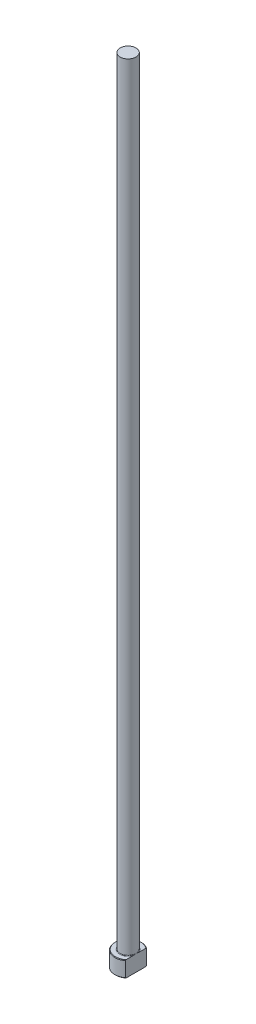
from build123d import *
from build123d.topology import SkipClean

# Parameters (mm, degrees)
CHAMFER1_SIZE    = 0.2
FILLET1_R        = 0.2
KEYED_HEAD_DEPTH = 301.083321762


with BuildPart() as part:
    # Sketch1 → Revolve1 (revolve)
    with BuildSketch(Plane.XY, mode=Mode.PRIVATE) as revolve1_sk:
        Polygon((0, 0), (-5, 0), (-5, 6), (-3, 6), (-3, 300), (0, 300), align=None)
    revolve(revolve1_sk.sketch.rotate(Axis((0, 259.958771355, 0), (0, -1, 0)), 270), axis=Axis((0, 259.958771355, 0), (0, -1, 0)))

    # Chamfer1
    chamfer1_edges = [part.edges().sort_by_distance(p)[0] for p in [
        (0, 6, -5),
        (0, 0, -5),
    ]]
    chamfer(chamfer1_edges, length=CHAMFER1_SIZE)

    # Fillet1
    fillet1_edges = [part.edges().sort_by_distance(p)[0] for p in [
        (0, 6, -3),
    ]]
    fillet(fillet1_edges, radius=FILLET1_R)

    # Sketch2 → KEYED HEAD (cut, through all)
    with SkipClean():  # the faces are left unmerged after this step: merging them gives an invalid solid
        with BuildSketch(Plane(origin=(0, 0, 0), x_dir=(1, 0, 0), z_dir=(0, 1, 0))):
            with BuildLine():
                Line((3, -4), (3, 4))
                ThreePointArc((3, 4), (5, 0), (3, -4))
            make_face()
        extrude(amount=KEYED_HEAD_DEPTH, mode=Mode.SUBTRACT)


solid = part.part
